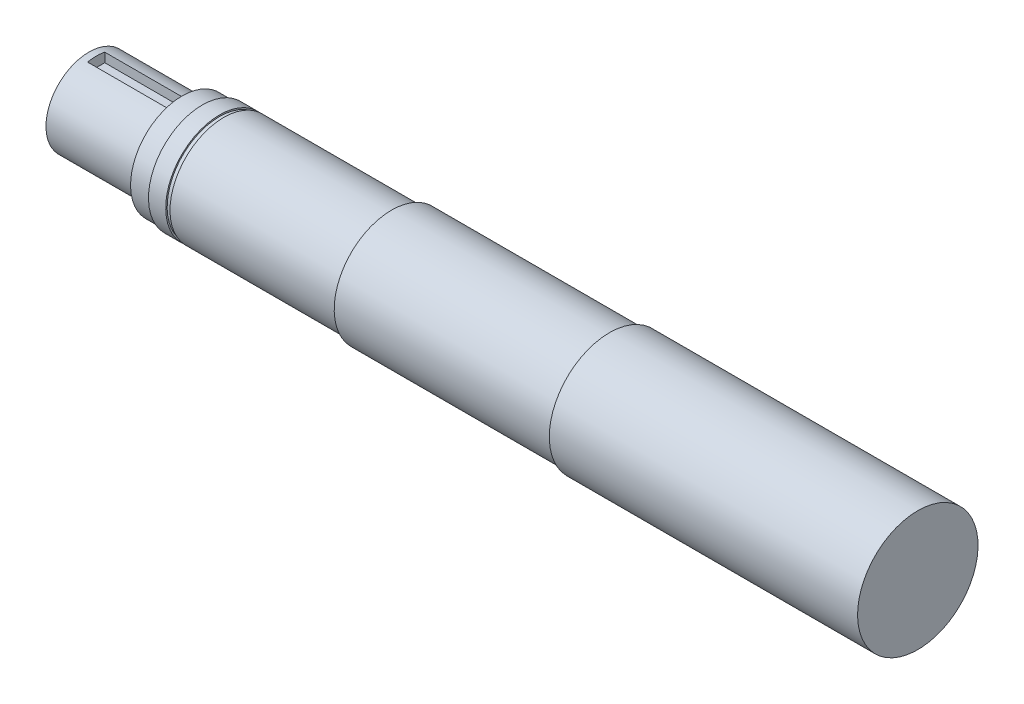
from build123d import *

# Parameters (mm, degrees)
SKETCH3_W          = 60
SKETCH3_H          = 12
CUT_EXTRUDE1_DEPTH = 584.157783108


with BuildPart() as part:
    # Sketch1 → Revolve1 (revolve)
    with BuildSketch(Plane.XY):
        Polygon((-367, 40), (-215, 40), (-215, 42), (0, 42), (0, 0), (-578, 0), (-578, 30), (-513, 30), (-513, 36), (-499, 36), (-499, 37.5), (-487, 37.5), (-487, 36.5), (-484, 36.5), (-484, 37.5), (-367, 37.5), align=None)
    revolve(axis=Axis((0, 0, 0), (-1, 0, 0)))

    # Sketch3 → Cut-Extrude1 (cut, through all)
    with BuildSketch(Plane(origin=(0, 23, 0), x_dir=(1, 0, 0), z_dir=(0, 1, 0))):
        with Locations((-543, 0)):
            Rectangle(SKETCH3_W, SKETCH3_H)
    extrude(amount=CUT_EXTRUDE1_DEPTH, mode=Mode.SUBTRACT)


solid = part.part
